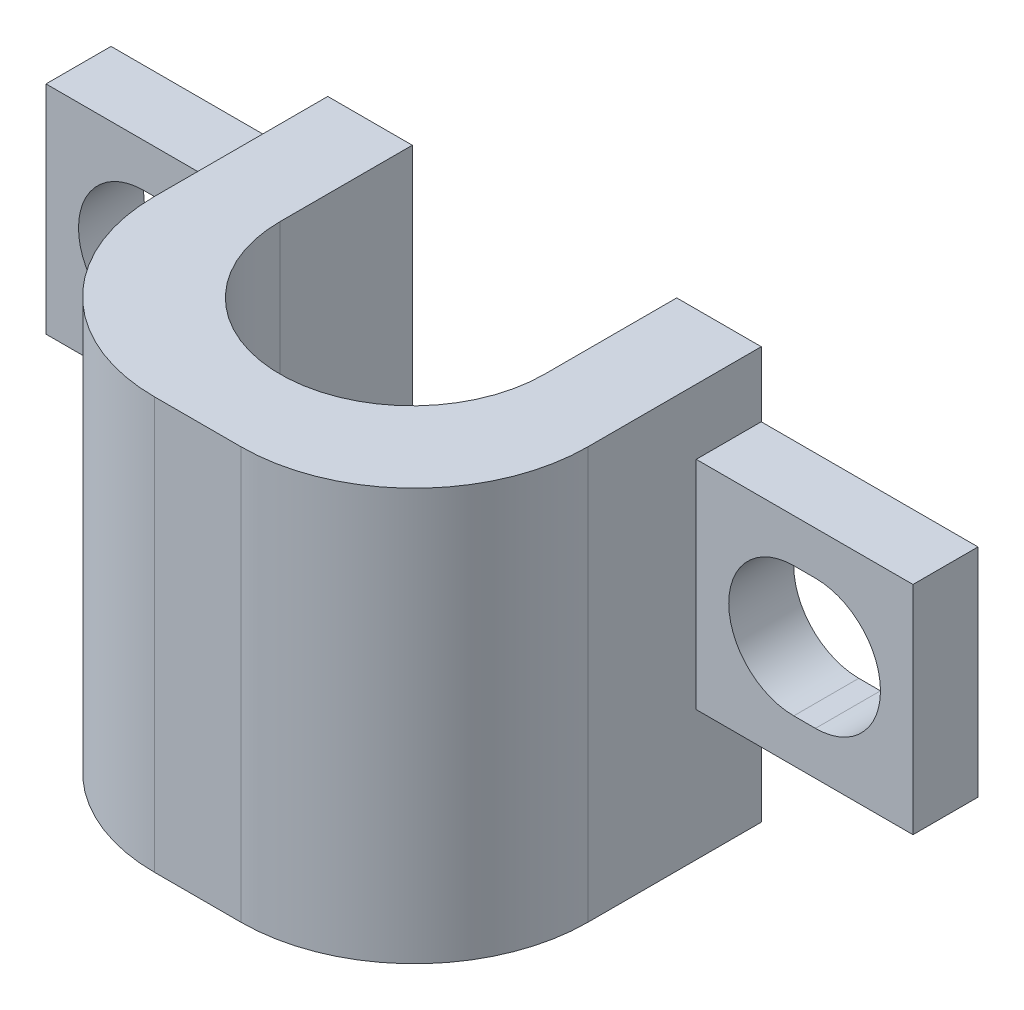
from build123d import *

# Parameters (mm, degrees)
BOSS_EXTRUDE1_DEPTH = 8
SKETCH2_W           = 5
SKETCH2_H           = 5
BOSS_EXTRUDE2_DEPTH = 1.5
BOSS_EXTRUDE3_START = 1.5
BOSS_EXTRUDE3_DEPTH = 1.5


with BuildPart() as part:
    # Sketch1 → Boss-Extrude1 (new body)
    with BuildSketch(Plane(origin=(0, 0, 0), x_dir=(1, 0, 0), z_dir=(0, 1, 0))):
        with BuildLine():
            Line((-3.05, 0), (-3.05, 3.05))
            Line((-3.05, 3.05), (-5, 3.05))
            Line((-5, 3.05), (-5, -0.95))
            ThreePointArc((-5, -0.95), (-3.828427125, -3.778427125), (-1, -4.95))
            Line((-1, -4.95), (1, -4.95))
            ThreePointArc((1, -4.95), (3.828427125, -3.778427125), (5, -0.95))
            Line((5, -0.95), (5, 3.05))
            Line((5, 3.05), (3.05, 3.05))
            Line((3.05, 3.05), (3.05, 0))
            ThreePointArc((3.05, 0), (0, -3.05), (-3.05, 0))
        make_face()
    extrude(amount=BOSS_EXTRUDE1_DEPTH)

    # Sketch2 → Boss-Extrude2 (add)
    with BuildSketch(Plane(origin=(0, 0, -3.05), x_dir=(-1, 0, 0), z_dir=(0, 0, -1))):
        with Locations((-7.5, 4)):
            Rectangle(SKETCH2_W, SKETCH2_H)
        with BuildLine():
            Line((-7.75, 5.5), (-7.25, 5.5))
            ThreePointArc((-7.25, 5.5), (-5.75, 4), (-7.25, 2.5))
            Line((-7.25, 2.5), (-7.75, 2.5))
            ThreePointArc((-7.75, 2.5), (-9.25, 4), (-7.75, 5.5))
        make_face(mode=Mode.SUBTRACT)
    boss_extrude2 = extrude(amount=-BOSS_EXTRUDE2_DEPTH)

    # Mirror1: Boss-Extrude2 across plane
    add(boss_extrude2.mirror(Plane(origin=(0, 0, 0), x_dir=(0, 0, 1), z_dir=(1, 0, 0))))

    # Sketch3 → Boss-Extrude3 (add)
    with BuildSketch(Plane.XZ.offset(BOSS_EXTRUDE3_START)):
        with BuildLine():
            Line((-2, 0), (-2, -3.05))
            Line((-2, -3.05), (-5, -3.05))
            Line((-5, -3.05), (-5, 0.95))
            ThreePointArc((-5, 0.95), (-3.828427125, 3.778427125), (-1, 4.95))
            Line((-1, 4.95), (1, 4.95))
            ThreePointArc((1, 4.95), (3.828427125, 3.778427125), (5, 0.95))
            Line((5, 0.95), (5, -3.05))
            Line((5, -3.05), (2, -3.05))
            Line((2, -3.05), (2, 0))
            ThreePointArc((2, 0), (0, 2), (-2, 0))
        make_face()
    extrude(amount=-BOSS_EXTRUDE3_DEPTH)


solid = part.part
